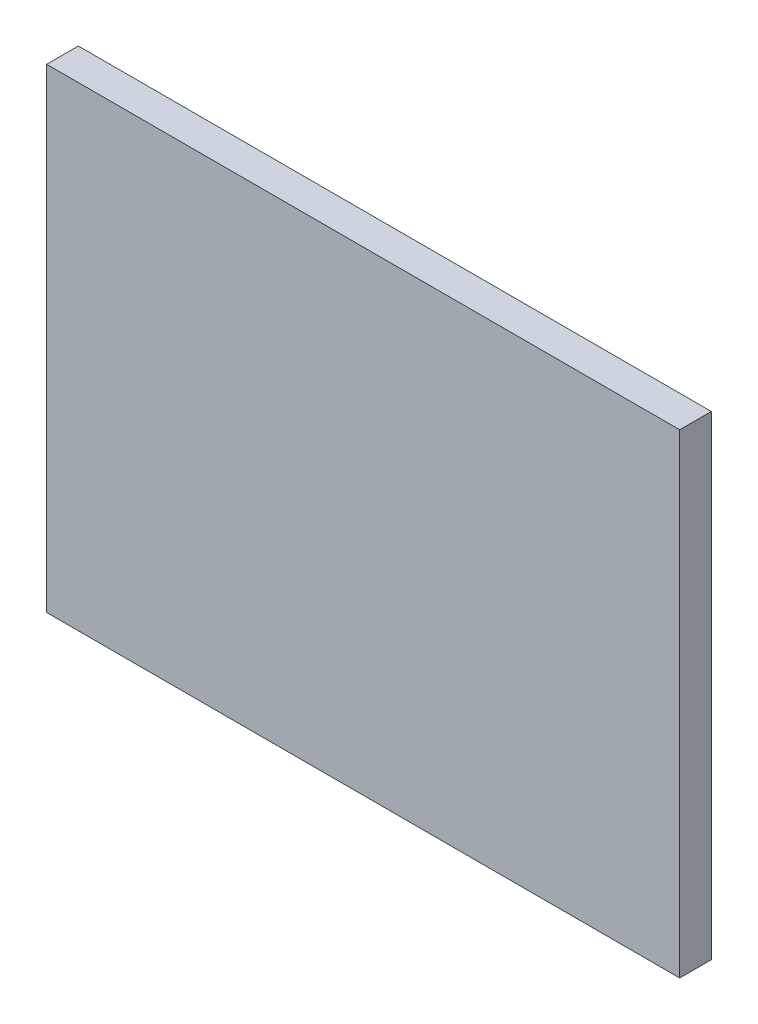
ISO-10303-21;
HEADER;
FILE_DESCRIPTION(('STEP AP214'),'2;1');
FILE_NAME('part.step','',(''),(''),'','','');
FILE_SCHEMA(('AUTOMOTIVE_DESIGN { 1 0 10303 214 1 1 1 1 }'));
ENDSEC;
DATA;
#1=APPLICATION_CONTEXT('core data for automotive mechanical design processes');
#2=APPLICATION_PROTOCOL_DEFINITION('international standard','automotive_design',2000,#1);
#3=PRODUCT_CONTEXT('',#1,'mechanical');
#4=PRODUCT('Part','Part','',(#3));
#5=PRODUCT_RELATED_PRODUCT_CATEGORY('part','',(#4));
#6=PRODUCT_DEFINITION_FORMATION('','',#4);
#7=PRODUCT_DEFINITION_CONTEXT('part definition',#1,'design');
#8=PRODUCT_DEFINITION('design','',#6,#7);
#9=PRODUCT_DEFINITION_SHAPE('','',#8);
#10=(LENGTH_UNIT() NAMED_UNIT(*) SI_UNIT(.MILLI.,.METRE.));
#11=(NAMED_UNIT(*) PLANE_ANGLE_UNIT() SI_UNIT($,.RADIAN.));
#12=(NAMED_UNIT(*) SI_UNIT($,.STERADIAN.) SOLID_ANGLE_UNIT());
#13=UNCERTAINTY_MEASURE_WITH_UNIT(LENGTH_MEASURE(1.E-05),#10,'distance_accuracy_value','');
#14=(GEOMETRIC_REPRESENTATION_CONTEXT(3) GLOBAL_UNCERTAINTY_ASSIGNED_CONTEXT((#13)) GLOBAL_UNIT_ASSIGNED_CONTEXT((#10,
#11,#12)) REPRESENTATION_CONTEXT('',''));
#15=CARTESIAN_POINT('',(0.,0.,0.));
#16=DIRECTION('',(0.,0.,1.));
#17=DIRECTION('',(1.,0.,0.));
#18=AXIS2_PLACEMENT_3D('',#15,#16,#17);
#19=CARTESIAN_POINT('',(0.,0.,5.));
#20=DIRECTION('',(1.,0.,0.));
#21=DIRECTION('',(0.,1.,0.));
#22=AXIS2_PLACEMENT_3D('',#19,#20,#21);
#23=PLANE('',#22);
#24=DIRECTION('',(0.,-1.,0.));
#25=VECTOR('',#24,1.);
#26=CARTESIAN_POINT('',(0.,0.,0.));
#27=LINE('',#26,#25);
#28=CARTESIAN_POINT('',(0.,0.,0.));
#29=VERTEX_POINT('',#28);
#30=CARTESIAN_POINT('',(0.,-75.,0.));
#31=VERTEX_POINT('',#30);
#32=EDGE_CURVE('E94',#29,#31,#27,.T.);
#33=ORIENTED_EDGE('',*,*,#32,.T.);
#34=DIRECTION('',(0.,0.,-1.));
#35=VECTOR('',#34,1.);
#36=CARTESIAN_POINT('',(0.,-75.,5.));
#37=LINE('',#36,#35);
#38=CARTESIAN_POINT('',(0.,-75.,5.));
#39=VERTEX_POINT('',#38);
#40=EDGE_CURVE('E11',#39,#31,#37,.T.);
#41=ORIENTED_EDGE('',*,*,#40,.F.);
#42=DIRECTION('',(0.,-1.,0.));
#43=VECTOR('',#42,1.);
#44=CARTESIAN_POINT('',(0.,0.,5.));
#45=LINE('',#44,#43);
#46=CARTESIAN_POINT('',(0.,0.,5.));
#47=VERTEX_POINT('',#46);
#48=EDGE_CURVE('E82',#47,#39,#45,.T.);
#49=ORIENTED_EDGE('',*,*,#48,.F.);
#50=DIRECTION('',(0.,0.,-1.));
#51=VECTOR('',#50,1.);
#52=CARTESIAN_POINT('',(0.,0.,5.));
#53=LINE('',#52,#51);
#54=EDGE_CURVE('E90',#47,#29,#53,.T.);
#55=ORIENTED_EDGE('',*,*,#54,.T.);
#56=EDGE_LOOP('',(#33,#41,#49,#55));
#57=FACE_BOUND('',#56,.T.);
#58=ADVANCED_FACE('F31',(#57),#23,.F.);
#59=CARTESIAN_POINT('',(0.,-75.,5.));
#60=DIRECTION('',(0.,1.,0.));
#61=DIRECTION('',(0.,0.,1.));
#62=AXIS2_PLACEMENT_3D('',#59,#60,#61);
#63=PLANE('',#62);
#64=DIRECTION('',(1.,0.,0.));
#65=VECTOR('',#64,1.);
#66=CARTESIAN_POINT('',(0.,-75.,0.));
#67=LINE('',#66,#65);
#68=CARTESIAN_POINT('',(100.,-75.,0.));
#69=VERTEX_POINT('',#68);
#70=EDGE_CURVE('E86',#31,#69,#67,.T.);
#71=ORIENTED_EDGE('',*,*,#70,.T.);
#72=DIRECTION('',(0.,0.,-1.));
#73=VECTOR('',#72,1.);
#74=CARTESIAN_POINT('',(100.,-75.,5.));
#75=LINE('',#74,#73);
#76=CARTESIAN_POINT('',(100.,-75.,5.));
#77=VERTEX_POINT('',#76);
#78=EDGE_CURVE('E39',#77,#69,#75,.T.);
#79=ORIENTED_EDGE('',*,*,#78,.F.);
#80=DIRECTION('',(1.,0.,0.));
#81=VECTOR('',#80,1.);
#82=CARTESIAN_POINT('',(0.,-75.,5.));
#83=LINE('',#82,#81);
#84=EDGE_CURVE('E77',#39,#77,#83,.T.);
#85=ORIENTED_EDGE('',*,*,#84,.F.);
#86=ORIENTED_EDGE('',*,*,#40,.T.);
#87=EDGE_LOOP('',(#71,#79,#85,#86));
#88=FACE_BOUND('',#87,.T.);
#89=ADVANCED_FACE('F85',(#88),#63,.F.);
#90=CARTESIAN_POINT('',(100.,0.,5.));
#91=DIRECTION('',(-1.,0.,0.));
#92=DIRECTION('',(0.,-1.,0.));
#93=AXIS2_PLACEMENT_3D('',#90,#91,#92);
#94=PLANE('',#93);
#95=DIRECTION('',(0.,1.,0.));
#96=VECTOR('',#95,1.);
#97=CARTESIAN_POINT('',(100.,0.,0.));
#98=LINE('',#97,#96);
#99=CARTESIAN_POINT('',(100.,0.,0.));
#100=VERTEX_POINT('',#99);
#101=EDGE_CURVE('E64',#69,#100,#98,.T.);
#102=ORIENTED_EDGE('',*,*,#101,.T.);
#103=DIRECTION('',(0.,0.,-1.));
#104=VECTOR('',#103,1.);
#105=CARTESIAN_POINT('',(100.,0.,5.));
#106=LINE('',#105,#104);
#107=CARTESIAN_POINT('',(100.,0.,5.));
#108=VERTEX_POINT('',#107);
#109=EDGE_CURVE('E87',#108,#100,#106,.T.);
#110=ORIENTED_EDGE('',*,*,#109,.F.);
#111=DIRECTION('',(0.,1.,0.));
#112=VECTOR('',#111,1.);
#113=CARTESIAN_POINT('',(100.,0.,5.));
#114=LINE('',#113,#112);
#115=EDGE_CURVE('E80',#77,#108,#114,.T.);
#116=ORIENTED_EDGE('',*,*,#115,.F.);
#117=ORIENTED_EDGE('',*,*,#78,.T.);
#118=EDGE_LOOP('',(#102,#110,#116,#117));
#119=FACE_BOUND('',#118,.T.);
#120=ADVANCED_FACE('F88',(#119),#94,.F.);
#121=CARTESIAN_POINT('',(0.,0.,5.));
#122=DIRECTION('',(0.,-1.,0.));
#123=DIRECTION('',(0.,0.,-1.));
#124=AXIS2_PLACEMENT_3D('',#121,#122,#123);
#125=PLANE('',#124);
#126=DIRECTION('',(-1.,0.,0.));
#127=VECTOR('',#126,1.);
#128=CARTESIAN_POINT('',(0.,0.,0.));
#129=LINE('',#128,#127);
#130=EDGE_CURVE('E70',#100,#29,#129,.T.);
#131=ORIENTED_EDGE('',*,*,#130,.T.);
#132=ORIENTED_EDGE('',*,*,#54,.F.);
#133=DIRECTION('',(-1.,0.,0.));
#134=VECTOR('',#133,1.);
#135=CARTESIAN_POINT('',(0.,0.,5.));
#136=LINE('',#135,#134);
#137=EDGE_CURVE('E47',#108,#47,#136,.T.);
#138=ORIENTED_EDGE('',*,*,#137,.F.);
#139=ORIENTED_EDGE('',*,*,#109,.T.);
#140=EDGE_LOOP('',(#131,#132,#138,#139));
#141=FACE_BOUND('',#140,.T.);
#142=ADVANCED_FACE('F101',(#141),#125,.F.);
#143=CARTESIAN_POINT('',(0.,-75.,5.));
#144=DIRECTION('',(0.,0.,1.));
#145=DIRECTION('',(1.,0.,0.));
#146=AXIS2_PLACEMENT_3D('',#143,#144,#145);
#147=PLANE('',#146);
#148=ORIENTED_EDGE('',*,*,#48,.T.);
#149=ORIENTED_EDGE('',*,*,#84,.T.);
#150=ORIENTED_EDGE('',*,*,#115,.T.);
#151=ORIENTED_EDGE('',*,*,#137,.T.);
#152=EDGE_LOOP('',(#148,#149,#150,#151));
#153=FACE_BOUND('',#152,.T.);
#154=ADVANCED_FACE('F78',(#153),#147,.T.);
#155=CARTESIAN_POINT('',(0.,-75.,0.));
#156=DIRECTION('',(0.,0.,1.));
#157=DIRECTION('',(1.,0.,0.));
#158=AXIS2_PLACEMENT_3D('',#155,#156,#157);
#159=PLANE('',#158);
#160=ORIENTED_EDGE('',*,*,#32,.F.);
#161=ORIENTED_EDGE('',*,*,#130,.F.);
#162=ORIENTED_EDGE('',*,*,#101,.F.);
#163=ORIENTED_EDGE('',*,*,#70,.F.);
#164=EDGE_LOOP('',(#160,#161,#162,#163));
#165=FACE_BOUND('',#164,.T.);
#166=ADVANCED_FACE('F104',(#165),#159,.F.);
#167=CLOSED_SHELL('',(#58,#89,#120,#142,#154,#166));
#168=MANIFOLD_SOLID_BREP('B2',#167);
#169=ADVANCED_BREP_SHAPE_REPRESENTATION('',(#18,#168),#14);
#170=SHAPE_DEFINITION_REPRESENTATION(#9,#169);
ENDSEC;
END-ISO-10303-21;
